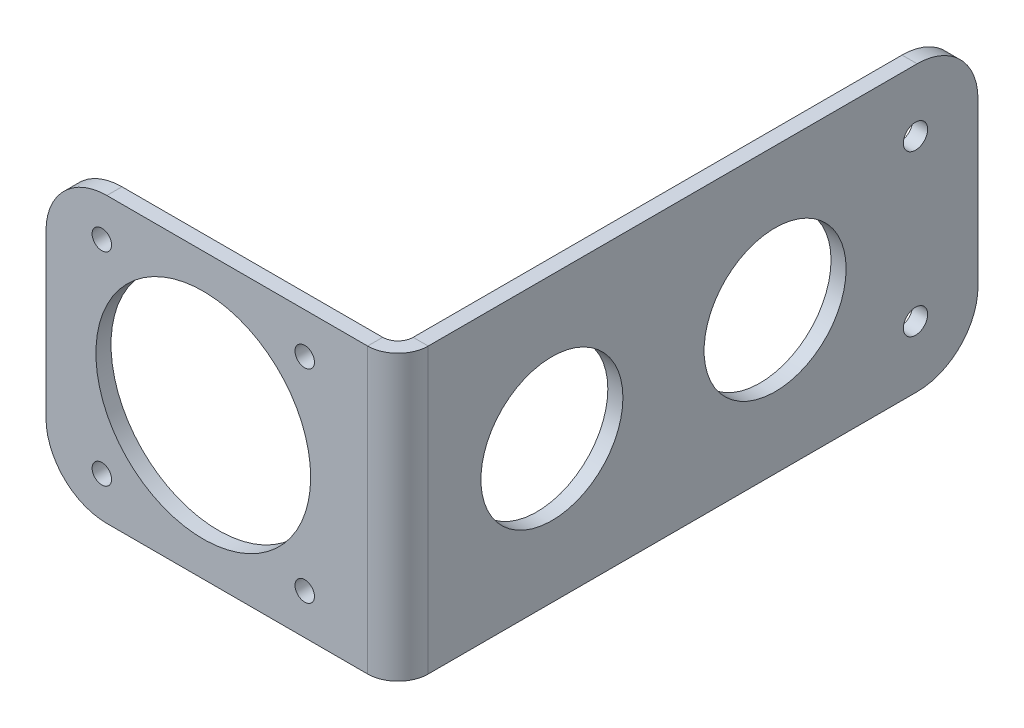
ISO-10303-21;
HEADER;
FILE_DESCRIPTION(('STEP AP214'),'2;1');
FILE_NAME('part.step','',(''),(''),'','','');
FILE_SCHEMA(('AUTOMOTIVE_DESIGN { 1 0 10303 214 1 1 1 1 }'));
ENDSEC;
DATA;
#1=APPLICATION_CONTEXT('core data for automotive mechanical design processes');
#2=APPLICATION_PROTOCOL_DEFINITION('international standard','automotive_design',2000,#1);
#3=PRODUCT_CONTEXT('',#1,'mechanical');
#4=PRODUCT('Part','Part','',(#3));
#5=PRODUCT_RELATED_PRODUCT_CATEGORY('part','',(#4));
#6=PRODUCT_DEFINITION_FORMATION('','',#4);
#7=PRODUCT_DEFINITION_CONTEXT('part definition',#1,'design');
#8=PRODUCT_DEFINITION('design','',#6,#7);
#9=PRODUCT_DEFINITION_SHAPE('','',#8);
#10=(LENGTH_UNIT() NAMED_UNIT(*) SI_UNIT(.MILLI.,.METRE.));
#11=(NAMED_UNIT(*) PLANE_ANGLE_UNIT() SI_UNIT($,.RADIAN.));
#12=(NAMED_UNIT(*) SI_UNIT($,.STERADIAN.) SOLID_ANGLE_UNIT());
#13=UNCERTAINTY_MEASURE_WITH_UNIT(LENGTH_MEASURE(1.E-05),#10,'distance_accuracy_value','');
#14=(GEOMETRIC_REPRESENTATION_CONTEXT(3) GLOBAL_UNCERTAINTY_ASSIGNED_CONTEXT((#13)) GLOBAL_UNIT_ASSIGNED_CONTEXT((#10,
#11,#12)) REPRESENTATION_CONTEXT('',''));
#15=CARTESIAN_POINT('',(0.,0.,0.));
#16=DIRECTION('',(0.,0.,1.));
#17=DIRECTION('',(1.,0.,0.));
#18=AXIS2_PLACEMENT_3D('',#15,#16,#17);
#19=CARTESIAN_POINT('',(28.0963964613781,22.225,49.7292035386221));
#20=DIRECTION('',(-1.,0.,0.));
#21=DIRECTION('',(0.,0.,1.));
#22=AXIS2_PLACEMENT_3D('',#19,#20,#21);
#23=PLANE('',#22);
#24=CARTESIAN_POINT('',(28.0963964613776,12.54125,-80.9918964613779));
#25=DIRECTION('',(1.,0.,0.));
#26=DIRECTION('',(0.,0.,-1.));
#27=AXIS2_PLACEMENT_3D('',#24,#25,#26);
#28=CIRCLE('',#27,1.89865000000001);
#29=CARTESIAN_POINT('',(28.0963964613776,12.54125,-82.8905464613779));
#30=VERTEX_POINT('',#29);
#31=EDGE_CURVE('E176',#30,#30,#28,.T.);
#32=ORIENTED_EDGE('',*,*,#31,.T.);
#33=EDGE_LOOP('',(#32));
#34=FACE_BOUND('',#33,.T.);
#35=CARTESIAN_POINT('',(28.0963964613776,-12.54125,-80.9918964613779));
#36=DIRECTION('',(1.,0.,0.));
#37=DIRECTION('',(0.,0.,-1.));
#38=AXIS2_PLACEMENT_3D('',#35,#36,#37);
#39=CIRCLE('',#38,1.89865000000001);
#40=CARTESIAN_POINT('',(28.0963964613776,-12.54125,-82.8905464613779));
#41=VERTEX_POINT('',#40);
#42=EDGE_CURVE('E291',#41,#41,#39,.T.);
#43=ORIENTED_EDGE('',*,*,#42,.T.);
#44=EDGE_LOOP('',(#43));
#45=FACE_BOUND('',#44,.T.);
#46=CARTESIAN_POINT('',(28.0963964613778,0.,-24.0958964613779));
#47=DIRECTION('',(1.,0.,0.));
#48=DIRECTION('',(0.,0.,-1.));
#49=AXIS2_PLACEMENT_3D('',#46,#47,#48);
#50=CIRCLE('',#49,11.1125);
#51=CARTESIAN_POINT('',(28.0963964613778,0.,-35.2083964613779));
#52=VERTEX_POINT('',#51);
#53=EDGE_CURVE('E285',#52,#52,#50,.T.);
#54=ORIENTED_EDGE('',*,*,#53,.T.);
#55=EDGE_LOOP('',(#54));
#56=FACE_BOUND('',#55,.T.);
#57=CARTESIAN_POINT('',(28.0963964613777,0.,-59.0208964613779));
#58=DIRECTION('',(1.,0.,0.));
#59=DIRECTION('',(0.,0.,-1.));
#60=AXIS2_PLACEMENT_3D('',#57,#58,#59);
#61=CIRCLE('',#60,11.1125);
#62=CARTESIAN_POINT('',(28.0963964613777,0.,-70.1333964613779));
#63=VERTEX_POINT('',#62);
#64=EDGE_CURVE('E279',#63,#63,#61,.T.);
#65=ORIENTED_EDGE('',*,*,#64,.T.);
#66=EDGE_LOOP('',(#65));
#67=FACE_BOUND('',#66,.T.);
#68=DIRECTION('',(0.,0.,1.));
#69=VECTOR('',#68,1.);
#70=CARTESIAN_POINT('',(28.0963964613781,22.225,49.7292035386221));
#71=LINE('',#70,#69);
#72=CARTESIAN_POINT('',(28.0963964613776,22.225,-81.2458964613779));
#73=VERTEX_POINT('',#72);
#74=CARTESIAN_POINT('',(28.0963964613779,22.225,-4.74345000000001));
#75=VERTEX_POINT('',#74);
#76=EDGE_CURVE('E144',#73,#75,#71,.T.);
#77=ORIENTED_EDGE('',*,*,#76,.F.);
#78=CARTESIAN_POINT('',(28.0963964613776,12.7,-81.2458964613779));
#79=DIRECTION('',(-1.,0.,0.));
#80=DIRECTION('',(0.,0.,1.));
#81=AXIS2_PLACEMENT_3D('',#78,#79,#80);
#82=CIRCLE('',#81,9.525);
#83=CARTESIAN_POINT('',(28.0963964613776,12.7,-90.7708964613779));
#84=VERTEX_POINT('',#83);
#85=EDGE_CURVE('E188',#73,#84,#82,.T.);
#86=ORIENTED_EDGE('',*,*,#85,.T.);
#87=DIRECTION('',(0.,1.,0.));
#88=VECTOR('',#87,1.);
#89=CARTESIAN_POINT('',(28.0963964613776,-22.225,-90.7708964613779));
#90=LINE('',#89,#88);
#91=CARTESIAN_POINT('',(28.0963964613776,-12.7,-90.7708964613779));
#92=VERTEX_POINT('',#91);
#93=EDGE_CURVE('E172',#92,#84,#90,.T.);
#94=ORIENTED_EDGE('',*,*,#93,.F.);
#95=CARTESIAN_POINT('',(28.0963964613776,-12.7,-81.2458964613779));
#96=DIRECTION('',(-1.,0.,0.));
#97=DIRECTION('',(0.,0.,1.));
#98=AXIS2_PLACEMENT_3D('',#95,#96,#97);
#99=CIRCLE('',#98,9.525);
#100=CARTESIAN_POINT('',(28.0963964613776,-22.225,-81.2458964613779));
#101=VERTEX_POINT('',#100);
#102=EDGE_CURVE('E186',#92,#101,#99,.T.);
#103=ORIENTED_EDGE('',*,*,#102,.T.);
#104=DIRECTION('',(0.,0.,-1.));
#105=VECTOR('',#104,1.);
#106=CARTESIAN_POINT('',(28.0963964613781,-22.225,49.7292035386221));
#107=LINE('',#106,#105);
#108=CARTESIAN_POINT('',(28.0963964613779,-22.225,-4.74345000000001));
#109=VERTEX_POINT('',#108);
#110=EDGE_CURVE('E136',#109,#101,#107,.T.);
#111=ORIENTED_EDGE('',*,*,#110,.F.);
#112=DIRECTION('',(0.,1.,0.));
#113=VECTOR('',#112,1.);
#114=CARTESIAN_POINT('',(28.0963964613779,22.225,-4.74345000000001));
#115=LINE('',#114,#113);
#116=EDGE_CURVE('E165',#109,#75,#115,.T.);
#117=ORIENTED_EDGE('',*,*,#116,.T.);
#118=EDGE_LOOP('',(#77,#86,#94,#103,#111,#117));
#119=FACE_BOUND('',#118,.T.);
#120=ADVANCED_FACE('F36',(#34,#45,#56,#67,#119),#23,.T.);
#121=CARTESIAN_POINT('',(28.0963964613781,-22.225,49.7292035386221));
#122=DIRECTION('',(0.,-1.,0.));
#123=DIRECTION('',(-1.,0.,0.));
#124=AXIS2_PLACEMENT_3D('',#121,#122,#123);
#125=PLANE('',#124);
#126=ORIENTED_EDGE('',*,*,#110,.T.);
#127=DIRECTION('',(1.,0.,0.));
#128=VECTOR('',#127,1.);
#129=CARTESIAN_POINT('',(28.0963964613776,-22.225,-81.2458964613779));
#130=LINE('',#129,#128);
#131=CARTESIAN_POINT('',(30.4585964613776,-22.225,-81.2458964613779));
#132=VERTEX_POINT('',#131);
#133=EDGE_CURVE('E190',#101,#132,#130,.T.);
#134=ORIENTED_EDGE('',*,*,#133,.T.);
#135=DIRECTION('',(0.,0.,-1.));
#136=VECTOR('',#135,1.);
#137=CARTESIAN_POINT('',(30.4585964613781,-22.225,49.7292035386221));
#138=LINE('',#137,#136);
#139=CARTESIAN_POINT('',(30.4585964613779,-22.225,-4.74345000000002));
#140=VERTEX_POINT('',#139);
#141=EDGE_CURVE('E174',#140,#132,#138,.T.);
#142=ORIENTED_EDGE('',*,*,#141,.F.);
#143=DIRECTION('',(-1.,0.,0.));
#144=VECTOR('',#143,1.);
#145=CARTESIAN_POINT('',(28.0963964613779,-22.225,-4.74345000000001));
#146=LINE('',#145,#144);
#147=EDGE_CURVE('E149',#140,#109,#146,.T.);
#148=ORIENTED_EDGE('',*,*,#147,.T.);
#149=EDGE_LOOP('',(#126,#134,#142,#148));
#150=FACE_BOUND('',#149,.T.);
#151=ADVANCED_FACE('F306',(#150),#125,.T.);
#152=CARTESIAN_POINT('',(28.0963964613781,22.225,49.7292035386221));
#153=DIRECTION('',(0.,1.,0.));
#154=DIRECTION('',(1.,0.,0.));
#155=AXIS2_PLACEMENT_3D('',#152,#153,#154);
#156=PLANE('',#155);
#157=DIRECTION('',(0.,0.,1.));
#158=VECTOR('',#157,1.);
#159=CARTESIAN_POINT('',(30.4585964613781,22.225,49.7292035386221));
#160=LINE('',#159,#158);
#161=CARTESIAN_POINT('',(30.4585964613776,22.225,-81.2458964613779));
#162=VERTEX_POINT('',#161);
#163=CARTESIAN_POINT('',(30.4585964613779,22.225,-4.74345000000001));
#164=VERTEX_POINT('',#163);
#165=EDGE_CURVE('E124',#162,#164,#160,.T.);
#166=ORIENTED_EDGE('',*,*,#165,.F.);
#167=DIRECTION('',(1.,0.,0.));
#168=VECTOR('',#167,1.);
#169=CARTESIAN_POINT('',(28.0963964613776,22.225,-81.2458964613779));
#170=LINE('',#169,#168);
#171=EDGE_CURVE('E184',#162,#73,#170,.F.);
#172=ORIENTED_EDGE('',*,*,#171,.T.);
#173=ORIENTED_EDGE('',*,*,#76,.T.);
#174=DIRECTION('',(1.,0.,0.));
#175=VECTOR('',#174,1.);
#176=CARTESIAN_POINT('',(28.0963964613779,22.225,-4.74345000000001));
#177=LINE('',#176,#175);
#178=EDGE_CURVE('E140',#75,#164,#177,.T.);
#179=ORIENTED_EDGE('',*,*,#178,.T.);
#180=EDGE_LOOP('',(#166,#172,#173,#179));
#181=FACE_BOUND('',#180,.T.);
#182=ADVANCED_FACE('F142',(#181),#156,.T.);
#183=CARTESIAN_POINT('',(28.0963964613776,-22.225,-90.7708964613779));
#184=DIRECTION('',(0.,0.,-1.));
#185=DIRECTION('',(-1.,0.,0.));
#186=AXIS2_PLACEMENT_3D('',#183,#184,#185);
#187=PLANE('',#186);
#188=ORIENTED_EDGE('',*,*,#93,.T.);
#189=DIRECTION('',(1.,0.,0.));
#190=VECTOR('',#189,1.);
#191=CARTESIAN_POINT('',(28.0963964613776,12.7,-90.7708964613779));
#192=LINE('',#191,#190);
#193=CARTESIAN_POINT('',(30.4585964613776,12.7,-90.7708964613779));
#194=VERTEX_POINT('',#193);
#195=EDGE_CURVE('E167',#84,#194,#192,.T.);
#196=ORIENTED_EDGE('',*,*,#195,.T.);
#197=DIRECTION('',(0.,1.,0.));
#198=VECTOR('',#197,1.);
#199=CARTESIAN_POINT('',(30.4585964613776,-22.225,-90.7708964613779));
#200=LINE('',#199,#198);
#201=CARTESIAN_POINT('',(30.4585964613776,-12.7,-90.7708964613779));
#202=VERTEX_POINT('',#201);
#203=EDGE_CURVE('E137',#202,#194,#200,.T.);
#204=ORIENTED_EDGE('',*,*,#203,.F.);
#205=DIRECTION('',(1.,0.,0.));
#206=VECTOR('',#205,1.);
#207=CARTESIAN_POINT('',(28.0963964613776,-12.7,-90.7708964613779));
#208=LINE('',#207,#206);
#209=EDGE_CURVE('E164',#202,#92,#208,.F.);
#210=ORIENTED_EDGE('',*,*,#209,.T.);
#211=EDGE_LOOP('',(#188,#196,#204,#210));
#212=FACE_BOUND('',#211,.T.);
#213=ADVANCED_FACE('F343',(#212),#187,.T.);
#214=CARTESIAN_POINT('',(30.4585964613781,22.225,49.7292035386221));
#215=DIRECTION('',(-1.,0.,0.));
#216=DIRECTION('',(0.,0.,1.));
#217=AXIS2_PLACEMENT_3D('',#214,#215,#216);
#218=PLANE('',#217);
#219=ORIENTED_EDGE('',*,*,#203,.T.);
#220=CARTESIAN_POINT('',(30.4585964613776,12.7,-81.2458964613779));
#221=DIRECTION('',(-1.,0.,0.));
#222=DIRECTION('',(0.,0.,1.));
#223=AXIS2_PLACEMENT_3D('',#220,#221,#222);
#224=CIRCLE('',#223,9.525);
#225=EDGE_CURVE('E133',#194,#162,#224,.F.);
#226=ORIENTED_EDGE('',*,*,#225,.T.);
#227=ORIENTED_EDGE('',*,*,#165,.T.);
#228=DIRECTION('',(0.,1.,0.));
#229=VECTOR('',#228,1.);
#230=CARTESIAN_POINT('',(30.4585964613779,22.225,-4.74345000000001));
#231=LINE('',#230,#229);
#232=EDGE_CURVE('E131',#140,#164,#231,.T.);
#233=ORIENTED_EDGE('',*,*,#232,.F.);
#234=ORIENTED_EDGE('',*,*,#141,.T.);
#235=CARTESIAN_POINT('',(30.4585964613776,-12.7,-81.2458964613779));
#236=DIRECTION('',(-1.,0.,0.));
#237=DIRECTION('',(0.,0.,1.));
#238=AXIS2_PLACEMENT_3D('',#235,#236,#237);
#239=CIRCLE('',#238,9.525);
#240=EDGE_CURVE('E181',#132,#202,#239,.F.);
#241=ORIENTED_EDGE('',*,*,#240,.T.);
#242=EDGE_LOOP('',(#219,#226,#227,#233,#234,#241));
#243=FACE_BOUND('',#242,.T.);
#244=CARTESIAN_POINT('',(30.4585964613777,0.,-59.0208964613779));
#245=DIRECTION('',(1.,0.,0.));
#246=DIRECTION('',(0.,0.,-1.));
#247=AXIS2_PLACEMENT_3D('',#244,#245,#246);
#248=CIRCLE('',#247,11.1125);
#249=CARTESIAN_POINT('',(30.4585964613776,0.,-70.1333964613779));
#250=VERTEX_POINT('',#249);
#251=EDGE_CURVE('E221',#250,#250,#248,.T.);
#252=ORIENTED_EDGE('',*,*,#251,.F.);
#253=EDGE_LOOP('',(#252));
#254=FACE_BOUND('',#253,.T.);
#255=CARTESIAN_POINT('',(30.4585964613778,0.,-24.0958964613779));
#256=DIRECTION('',(1.,0.,0.));
#257=DIRECTION('',(0.,0.,-1.));
#258=AXIS2_PLACEMENT_3D('',#255,#256,#257);
#259=CIRCLE('',#258,11.1125);
#260=CARTESIAN_POINT('',(30.4585964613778,0.,-35.2083964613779));
#261=VERTEX_POINT('',#260);
#262=EDGE_CURVE('E282',#261,#261,#259,.T.);
#263=ORIENTED_EDGE('',*,*,#262,.F.);
#264=EDGE_LOOP('',(#263));
#265=FACE_BOUND('',#264,.T.);
#266=CARTESIAN_POINT('',(30.4585964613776,-12.54125,-80.9918964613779));
#267=DIRECTION('',(1.,0.,0.));
#268=DIRECTION('',(0.,0.,-1.));
#269=AXIS2_PLACEMENT_3D('',#266,#267,#268);
#270=CIRCLE('',#269,1.89865000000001);
#271=CARTESIAN_POINT('',(30.4585964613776,-12.54125,-82.8905464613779));
#272=VERTEX_POINT('',#271);
#273=EDGE_CURVE('E288',#272,#272,#270,.T.);
#274=ORIENTED_EDGE('',*,*,#273,.F.);
#275=EDGE_LOOP('',(#274));
#276=FACE_BOUND('',#275,.T.);
#277=CARTESIAN_POINT('',(30.4585964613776,12.54125,-80.9918964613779));
#278=DIRECTION('',(1.,0.,0.));
#279=DIRECTION('',(0.,0.,-1.));
#280=AXIS2_PLACEMENT_3D('',#277,#278,#279);
#281=CIRCLE('',#280,1.89865000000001);
#282=CARTESIAN_POINT('',(30.4585964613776,12.54125,-82.8905464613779));
#283=VERTEX_POINT('',#282);
#284=EDGE_CURVE('E294',#283,#283,#281,.T.);
#285=ORIENTED_EDGE('',*,*,#284,.F.);
#286=EDGE_LOOP('',(#285));
#287=FACE_BOUND('',#286,.T.);
#288=ADVANCED_FACE('F127',(#243,#254,#265,#276,#287),#218,.F.);
#289=CARTESIAN_POINT('',(28.0963964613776,12.54125,-80.9918964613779));
#290=DIRECTION('',(1.,0.,0.));
#291=DIRECTION('',(0.,0.,-1.));
#292=AXIS2_PLACEMENT_3D('',#289,#290,#291);
#293=CYLINDRICAL_SURFACE('',#292,1.89865000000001);
#294=ORIENTED_EDGE('',*,*,#31,.F.);
#295=EDGE_LOOP('',(#294));
#296=FACE_BOUND('',#295,.T.);
#297=ORIENTED_EDGE('',*,*,#284,.T.);
#298=EDGE_LOOP('',(#297));
#299=FACE_BOUND('',#298,.T.);
#300=ADVANCED_FACE('F348',(#296,#299),#293,.F.);
#301=CARTESIAN_POINT('',(28.0963964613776,-12.54125,-80.9918964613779));
#302=DIRECTION('',(1.,0.,0.));
#303=DIRECTION('',(0.,0.,-1.));
#304=AXIS2_PLACEMENT_3D('',#301,#302,#303);
#305=CYLINDRICAL_SURFACE('',#304,1.89865000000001);
#306=ORIENTED_EDGE('',*,*,#42,.F.);
#307=EDGE_LOOP('',(#306));
#308=FACE_BOUND('',#307,.T.);
#309=ORIENTED_EDGE('',*,*,#273,.T.);
#310=EDGE_LOOP('',(#309));
#311=FACE_BOUND('',#310,.T.);
#312=ADVANCED_FACE('F546',(#308,#311),#305,.F.);
#313=CARTESIAN_POINT('',(28.0963964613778,0.,-24.0958964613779));
#314=DIRECTION('',(1.,0.,0.));
#315=DIRECTION('',(0.,0.,-1.));
#316=AXIS2_PLACEMENT_3D('',#313,#314,#315);
#317=CYLINDRICAL_SURFACE('',#316,11.1125);
#318=ORIENTED_EDGE('',*,*,#53,.F.);
#319=EDGE_LOOP('',(#318));
#320=FACE_BOUND('',#319,.T.);
#321=ORIENTED_EDGE('',*,*,#262,.T.);
#322=EDGE_LOOP('',(#321));
#323=FACE_BOUND('',#322,.T.);
#324=ADVANCED_FACE('F536',(#320,#323),#317,.F.);
#325=CARTESIAN_POINT('',(28.0963964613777,0.,-59.0208964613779));
#326=DIRECTION('',(1.,0.,0.));
#327=DIRECTION('',(0.,0.,-1.));
#328=AXIS2_PLACEMENT_3D('',#325,#326,#327);
#329=CYLINDRICAL_SURFACE('',#328,11.1125);
#330=ORIENTED_EDGE('',*,*,#64,.F.);
#331=EDGE_LOOP('',(#330));
#332=FACE_BOUND('',#331,.T.);
#333=ORIENTED_EDGE('',*,*,#251,.T.);
#334=EDGE_LOOP('',(#333));
#335=FACE_BOUND('',#334,.T.);
#336=ADVANCED_FACE('F526',(#332,#335),#329,.F.);
#337=CARTESIAN_POINT('',(0.,0.,-2.3622));
#338=DIRECTION('',(0.,0.,1.));
#339=DIRECTION('',(1.,0.,0.));
#340=AXIS2_PLACEMENT_3D('',#337,#338,#339);
#341=CYLINDRICAL_SURFACE('',#340,16.8021);
#342=CARTESIAN_POINT('',(0.,0.,-2.3622));
#343=DIRECTION('',(0.,0.,1.));
#344=DIRECTION('',(1.,0.,0.));
#345=AXIS2_PLACEMENT_3D('',#342,#343,#344);
#346=CIRCLE('',#345,16.8021);
#347=CARTESIAN_POINT('',(16.8021,0.,-2.3622));
#348=VERTEX_POINT('',#347);
#349=EDGE_CURVE('E243',#348,#348,#346,.T.);
#350=ORIENTED_EDGE('',*,*,#349,.F.);
#351=EDGE_LOOP('',(#350));
#352=FACE_BOUND('',#351,.T.);
#353=CARTESIAN_POINT('',(0.,0.,0.));
#354=DIRECTION('',(0.,0.,1.));
#355=DIRECTION('',(1.,0.,0.));
#356=AXIS2_PLACEMENT_3D('',#353,#354,#355);
#357=CIRCLE('',#356,16.8021);
#358=CARTESIAN_POINT('',(16.8021,0.,0.));
#359=VERTEX_POINT('',#358);
#360=EDGE_CURVE('E271',#359,#359,#357,.T.);
#361=ORIENTED_EDGE('',*,*,#360,.T.);
#362=EDGE_LOOP('',(#361));
#363=FACE_BOUND('',#362,.T.);
#364=ADVANCED_FACE('F516',(#352,#363),#341,.F.);
#365=CARTESIAN_POINT('',(15.875,15.875,-2.3622));
#366=DIRECTION('',(0.,0.,1.));
#367=DIRECTION('',(1.,0.,0.));
#368=AXIS2_PLACEMENT_3D('',#365,#366,#367);
#369=CYLINDRICAL_SURFACE('',#368,1.52400000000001);
#370=CARTESIAN_POINT('',(15.875,15.875,-2.3622));
#371=DIRECTION('',(0.,0.,1.));
#372=DIRECTION('',(1.,0.,0.));
#373=AXIS2_PLACEMENT_3D('',#370,#371,#372);
#374=CIRCLE('',#373,1.52400000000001);
#375=CARTESIAN_POINT('',(17.399,15.875,-2.3622));
#376=VERTEX_POINT('',#375);
#377=EDGE_CURVE('E246',#376,#376,#374,.T.);
#378=ORIENTED_EDGE('',*,*,#377,.F.);
#379=EDGE_LOOP('',(#378));
#380=FACE_BOUND('',#379,.T.);
#381=CARTESIAN_POINT('',(15.875,15.875,0.));
#382=DIRECTION('',(0.,0.,1.));
#383=DIRECTION('',(1.,0.,0.));
#384=AXIS2_PLACEMENT_3D('',#381,#382,#383);
#385=CIRCLE('',#384,1.52400000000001);
#386=CARTESIAN_POINT('',(17.399,15.875,0.));
#387=VERTEX_POINT('',#386);
#388=EDGE_CURVE('E268',#387,#387,#385,.T.);
#389=ORIENTED_EDGE('',*,*,#388,.T.);
#390=EDGE_LOOP('',(#389));
#391=FACE_BOUND('',#390,.T.);
#392=ADVANCED_FACE('F506',(#380,#391),#369,.F.);
#393=CARTESIAN_POINT('',(-15.875,15.875,-2.3622));
#394=DIRECTION('',(0.,0.,1.));
#395=DIRECTION('',(1.,0.,0.));
#396=AXIS2_PLACEMENT_3D('',#393,#394,#395);
#397=CYLINDRICAL_SURFACE('',#396,1.524);
#398=CARTESIAN_POINT('',(-15.875,15.875,-2.3622));
#399=DIRECTION('',(0.,0.,1.));
#400=DIRECTION('',(1.,0.,0.));
#401=AXIS2_PLACEMENT_3D('',#398,#399,#400);
#402=CIRCLE('',#401,1.524);
#403=CARTESIAN_POINT('',(-14.351,15.875,-2.3622));
#404=VERTEX_POINT('',#403);
#405=EDGE_CURVE('E249',#404,#404,#402,.T.);
#406=ORIENTED_EDGE('',*,*,#405,.F.);
#407=EDGE_LOOP('',(#406));
#408=FACE_BOUND('',#407,.T.);
#409=CARTESIAN_POINT('',(-15.875,15.875,0.));
#410=DIRECTION('',(0.,0.,1.));
#411=DIRECTION('',(1.,0.,0.));
#412=AXIS2_PLACEMENT_3D('',#409,#410,#411);
#413=CIRCLE('',#412,1.524);
#414=CARTESIAN_POINT('',(-14.351,15.875,0.));
#415=VERTEX_POINT('',#414);
#416=EDGE_CURVE('E265',#415,#415,#413,.T.);
#417=ORIENTED_EDGE('',*,*,#416,.T.);
#418=EDGE_LOOP('',(#417));
#419=FACE_BOUND('',#418,.T.);
#420=ADVANCED_FACE('F496',(#408,#419),#397,.F.);
#421=CARTESIAN_POINT('',(-15.875,-15.875,-2.3622));
#422=DIRECTION('',(0.,0.,1.));
#423=DIRECTION('',(1.,0.,0.));
#424=AXIS2_PLACEMENT_3D('',#421,#422,#423);
#425=CYLINDRICAL_SURFACE('',#424,1.524);
#426=CARTESIAN_POINT('',(-15.875,-15.875,-2.3622));
#427=DIRECTION('',(0.,0.,1.));
#428=DIRECTION('',(1.,0.,0.));
#429=AXIS2_PLACEMENT_3D('',#426,#427,#428);
#430=CIRCLE('',#429,1.524);
#431=CARTESIAN_POINT('',(-14.351,-15.875,-2.3622));
#432=VERTEX_POINT('',#431);
#433=EDGE_CURVE('E252',#432,#432,#430,.T.);
#434=ORIENTED_EDGE('',*,*,#433,.F.);
#435=EDGE_LOOP('',(#434));
#436=FACE_BOUND('',#435,.T.);
#437=CARTESIAN_POINT('',(-15.875,-15.875,0.));
#438=DIRECTION('',(0.,0.,1.));
#439=DIRECTION('',(1.,0.,0.));
#440=AXIS2_PLACEMENT_3D('',#437,#438,#439);
#441=CIRCLE('',#440,1.524);
#442=CARTESIAN_POINT('',(-14.351,-15.875,0.));
#443=VERTEX_POINT('',#442);
#444=EDGE_CURVE('E262',#443,#443,#441,.T.);
#445=ORIENTED_EDGE('',*,*,#444,.T.);
#446=EDGE_LOOP('',(#445));
#447=FACE_BOUND('',#446,.T.);
#448=ADVANCED_FACE('F486',(#436,#447),#425,.F.);
#449=CARTESIAN_POINT('',(15.875,-15.875,-2.3622));
#450=DIRECTION('',(0.,0.,1.));
#451=DIRECTION('',(1.,0.,0.));
#452=AXIS2_PLACEMENT_3D('',#449,#450,#451);
#453=CYLINDRICAL_SURFACE('',#452,1.52400000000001);
#454=CARTESIAN_POINT('',(15.875,-15.875,-2.3622));
#455=DIRECTION('',(0.,0.,1.));
#456=DIRECTION('',(1.,0.,0.));
#457=AXIS2_PLACEMENT_3D('',#454,#455,#456);
#458=CIRCLE('',#457,1.52400000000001);
#459=CARTESIAN_POINT('',(17.399,-15.875,-2.3622));
#460=VERTEX_POINT('',#459);
#461=EDGE_CURVE('E255',#460,#460,#458,.T.);
#462=ORIENTED_EDGE('',*,*,#461,.F.);
#463=EDGE_LOOP('',(#462));
#464=FACE_BOUND('',#463,.T.);
#465=CARTESIAN_POINT('',(15.875,-15.875,0.));
#466=DIRECTION('',(0.,0.,1.));
#467=DIRECTION('',(1.,0.,0.));
#468=AXIS2_PLACEMENT_3D('',#465,#466,#467);
#469=CIRCLE('',#468,1.52400000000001);
#470=CARTESIAN_POINT('',(17.399,-15.875,0.));
#471=VERTEX_POINT('',#470);
#472=EDGE_CURVE('E259',#471,#471,#469,.T.);
#473=ORIENTED_EDGE('',*,*,#472,.T.);
#474=EDGE_LOOP('',(#473));
#475=FACE_BOUND('',#474,.T.);
#476=ADVANCED_FACE('F417',(#464,#475),#453,.F.);
#477=CARTESIAN_POINT('',(-24.6126,-22.225,-2.3622));
#478=DIRECTION('',(-1.,0.,0.));
#479=DIRECTION('',(0.,0.,1.));
#480=AXIS2_PLACEMENT_3D('',#477,#478,#479);
#481=PLANE('',#480);
#482=DIRECTION('',(0.,-1.,0.));
#483=VECTOR('',#482,1.);
#484=CARTESIAN_POINT('',(-24.6126,-22.225,0.));
#485=LINE('',#484,#483);
#486=CARTESIAN_POINT('',(-24.6126,12.7,0.));
#487=VERTEX_POINT('',#486);
#488=CARTESIAN_POINT('',(-24.6126,-12.7,0.));
#489=VERTEX_POINT('',#488);
#490=EDGE_CURVE('E222',#487,#489,#485,.T.);
#491=ORIENTED_EDGE('',*,*,#490,.F.);
#492=DIRECTION('',(0.,0.,1.));
#493=VECTOR('',#492,1.);
#494=CARTESIAN_POINT('',(-24.6126,12.7,-2.3622));
#495=LINE('',#494,#493);
#496=CARTESIAN_POINT('',(-24.6126,12.7,-2.3622));
#497=VERTEX_POINT('',#496);
#498=EDGE_CURVE('E203',#487,#497,#495,.F.);
#499=ORIENTED_EDGE('',*,*,#498,.T.);
#500=DIRECTION('',(0.,-1.,0.));
#501=VECTOR('',#500,1.);
#502=CARTESIAN_POINT('',(-24.6126,-22.225,-2.3622));
#503=LINE('',#502,#501);
#504=CARTESIAN_POINT('',(-24.6126,-12.7,-2.3622));
#505=VERTEX_POINT('',#504);
#506=EDGE_CURVE('E213',#497,#505,#503,.T.);
#507=ORIENTED_EDGE('',*,*,#506,.T.);
#508=DIRECTION('',(0.,0.,1.));
#509=VECTOR('',#508,1.);
#510=CARTESIAN_POINT('',(-24.6126,-12.7,-2.3622));
#511=LINE('',#510,#509);
#512=EDGE_CURVE('E200',#505,#489,#511,.T.);
#513=ORIENTED_EDGE('',*,*,#512,.T.);
#514=EDGE_LOOP('',(#491,#499,#507,#513));
#515=FACE_BOUND('',#514,.T.);
#516=ADVANCED_FACE('F231',(#515),#481,.T.);
#517=CARTESIAN_POINT('',(-24.6126,22.225,-2.3622));
#518=DIRECTION('',(0.,0.,-1.));
#519=DIRECTION('',(-1.,0.,0.));
#520=AXIS2_PLACEMENT_3D('',#517,#518,#519);
#521=PLANE('',#520);
#522=ORIENTED_EDGE('',*,*,#506,.F.);
#523=CARTESIAN_POINT('',(-15.0876,12.7,-2.3622));
#524=DIRECTION('',(0.,0.,-1.));
#525=DIRECTION('',(-1.,0.,0.));
#526=AXIS2_PLACEMENT_3D('',#523,#524,#525);
#527=CIRCLE('',#526,9.525);
#528=CARTESIAN_POINT('',(-15.0876,22.225,-2.3622));
#529=VERTEX_POINT('',#528);
#530=EDGE_CURVE('E44',#497,#529,#527,.T.);
#531=ORIENTED_EDGE('',*,*,#530,.T.);
#532=DIRECTION('',(-1.,0.,0.));
#533=VECTOR('',#532,1.);
#534=CARTESIAN_POINT('',(-24.6126,22.225,-2.3622));
#535=LINE('',#534,#533);
#536=CARTESIAN_POINT('',(25.7151464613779,22.225,-2.3622));
#537=VERTEX_POINT('',#536);
#538=EDGE_CURVE('E211',#537,#529,#535,.T.);
#539=ORIENTED_EDGE('',*,*,#538,.F.);
#540=DIRECTION('',(0.,1.,0.));
#541=VECTOR('',#540,1.);
#542=CARTESIAN_POINT('',(25.7151464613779,22.225,-2.3622));
#543=LINE('',#542,#541);
#544=CARTESIAN_POINT('',(25.7151464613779,-22.225,-2.3622));
#545=VERTEX_POINT('',#544);
#546=EDGE_CURVE('E158',#545,#537,#543,.T.);
#547=ORIENTED_EDGE('',*,*,#546,.F.);
#548=DIRECTION('',(1.,0.,0.));
#549=VECTOR('',#548,1.);
#550=CARTESIAN_POINT('',(-24.6126,-22.225,-2.3622));
#551=LINE('',#550,#549);
#552=CARTESIAN_POINT('',(-15.0876,-22.225,-2.3622));
#553=VERTEX_POINT('',#552);
#554=EDGE_CURVE('E241',#553,#545,#551,.T.);
#555=ORIENTED_EDGE('',*,*,#554,.F.);
#556=CARTESIAN_POINT('',(-15.0876,-12.7,-2.3622));
#557=DIRECTION('',(0.,0.,-1.));
#558=DIRECTION('',(-1.,0.,0.));
#559=AXIS2_PLACEMENT_3D('',#556,#557,#558);
#560=CIRCLE('',#559,9.525);
#561=EDGE_CURVE('E56',#553,#505,#560,.T.);
#562=ORIENTED_EDGE('',*,*,#561,.T.);
#563=EDGE_LOOP('',(#522,#531,#539,#547,#555,#562));
#564=FACE_BOUND('',#563,.T.);
#565=ORIENTED_EDGE('',*,*,#461,.T.);
#566=EDGE_LOOP('',(#565));
#567=FACE_BOUND('',#566,.T.);
#568=ORIENTED_EDGE('',*,*,#433,.T.);
#569=EDGE_LOOP('',(#568));
#570=FACE_BOUND('',#569,.T.);
#571=ORIENTED_EDGE('',*,*,#405,.T.);
#572=EDGE_LOOP('',(#571));
#573=FACE_BOUND('',#572,.T.);
#574=ORIENTED_EDGE('',*,*,#377,.T.);
#575=EDGE_LOOP('',(#574));
#576=FACE_BOUND('',#575,.T.);
#577=ORIENTED_EDGE('',*,*,#349,.T.);
#578=EDGE_LOOP('',(#577));
#579=FACE_BOUND('',#578,.T.);
#580=ADVANCED_FACE('F208',(#564,#567,#570,#573,#576,#579),#521,.T.);
#581=CARTESIAN_POINT('',(-24.6126,-22.225,-2.3622));
#582=DIRECTION('',(0.,-1.,0.));
#583=DIRECTION('',(0.,0.,-1.));
#584=AXIS2_PLACEMENT_3D('',#581,#582,#583);
#585=PLANE('',#584);
#586=DIRECTION('',(1.,0.,0.));
#587=VECTOR('',#586,1.);
#588=CARTESIAN_POINT('',(-24.6126,-22.225,0.));
#589=LINE('',#588,#587);
#590=CARTESIAN_POINT('',(-15.0876,-22.225,0.));
#591=VERTEX_POINT('',#590);
#592=CARTESIAN_POINT('',(25.7151464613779,-22.225,0.));
#593=VERTEX_POINT('',#592);
#594=EDGE_CURVE('E239',#591,#593,#589,.T.);
#595=ORIENTED_EDGE('',*,*,#594,.F.);
#596=DIRECTION('',(0.,0.,1.));
#597=VECTOR('',#596,1.);
#598=CARTESIAN_POINT('',(-15.0876,-22.225,-2.3622));
#599=LINE('',#598,#597);
#600=EDGE_CURVE('E11',#591,#553,#599,.F.);
#601=ORIENTED_EDGE('',*,*,#600,.T.);
#602=ORIENTED_EDGE('',*,*,#554,.T.);
#603=DIRECTION('',(0.,0.,-1.));
#604=VECTOR('',#603,1.);
#605=CARTESIAN_POINT('',(25.7151464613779,-22.225,-2.3622));
#606=LINE('',#605,#604);
#607=EDGE_CURVE('E274',#593,#545,#606,.T.);
#608=ORIENTED_EDGE('',*,*,#607,.F.);
#609=EDGE_LOOP('',(#595,#601,#602,#608));
#610=FACE_BOUND('',#609,.T.);
#611=ADVANCED_FACE('F324',(#610),#585,.T.);
#612=CARTESIAN_POINT('',(-24.6126,22.225,0.));
#613=DIRECTION('',(0.,0.,-1.));
#614=DIRECTION('',(-1.,0.,0.));
#615=AXIS2_PLACEMENT_3D('',#612,#613,#614);
#616=PLANE('',#615);
#617=ORIENTED_EDGE('',*,*,#472,.F.);
#618=EDGE_LOOP('',(#617));
#619=FACE_BOUND('',#618,.T.);
#620=ORIENTED_EDGE('',*,*,#444,.F.);
#621=EDGE_LOOP('',(#620));
#622=FACE_BOUND('',#621,.T.);
#623=ORIENTED_EDGE('',*,*,#416,.F.);
#624=EDGE_LOOP('',(#623));
#625=FACE_BOUND('',#624,.T.);
#626=ORIENTED_EDGE('',*,*,#388,.F.);
#627=EDGE_LOOP('',(#626));
#628=FACE_BOUND('',#627,.T.);
#629=ORIENTED_EDGE('',*,*,#360,.F.);
#630=EDGE_LOOP('',(#629));
#631=FACE_BOUND('',#630,.T.);
#632=DIRECTION('',(-1.,0.,0.));
#633=VECTOR('',#632,1.);
#634=CARTESIAN_POINT('',(-24.6126,22.225,0.));
#635=LINE('',#634,#633);
#636=CARTESIAN_POINT('',(25.7151464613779,22.225,0.));
#637=VERTEX_POINT('',#636);
#638=CARTESIAN_POINT('',(-15.0876,22.225,0.));
#639=VERTEX_POINT('',#638);
#640=EDGE_CURVE('E229',#637,#639,#635,.T.);
#641=ORIENTED_EDGE('',*,*,#640,.T.);
#642=CARTESIAN_POINT('',(-15.0876,12.7,0.));
#643=DIRECTION('',(0.,0.,-1.));
#644=DIRECTION('',(-1.,0.,0.));
#645=AXIS2_PLACEMENT_3D('',#642,#643,#644);
#646=CIRCLE('',#645,9.525);
#647=EDGE_CURVE('E198',#639,#487,#646,.F.);
#648=ORIENTED_EDGE('',*,*,#647,.T.);
#649=ORIENTED_EDGE('',*,*,#490,.T.);
#650=CARTESIAN_POINT('',(-15.0876,-12.7,0.));
#651=DIRECTION('',(0.,0.,-1.));
#652=DIRECTION('',(-1.,0.,0.));
#653=AXIS2_PLACEMENT_3D('',#650,#651,#652);
#654=CIRCLE('',#653,9.525);
#655=EDGE_CURVE('E196',#489,#591,#654,.F.);
#656=ORIENTED_EDGE('',*,*,#655,.T.);
#657=ORIENTED_EDGE('',*,*,#594,.T.);
#658=DIRECTION('',(0.,1.,0.));
#659=VECTOR('',#658,1.);
#660=CARTESIAN_POINT('',(25.7151464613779,22.225,0.));
#661=LINE('',#660,#659);
#662=EDGE_CURVE('E234',#593,#637,#661,.T.);
#663=ORIENTED_EDGE('',*,*,#662,.T.);
#664=EDGE_LOOP('',(#641,#648,#649,#656,#657,#663));
#665=FACE_BOUND('',#664,.T.);
#666=ADVANCED_FACE('F228',(#619,#622,#625,#628,#631,#665),#616,.F.);
#667=CARTESIAN_POINT('',(-24.6126,22.225,-2.3622));
#668=DIRECTION('',(0.,1.,0.));
#669=DIRECTION('',(0.,0.,1.));
#670=AXIS2_PLACEMENT_3D('',#667,#668,#669);
#671=PLANE('',#670);
#672=ORIENTED_EDGE('',*,*,#538,.T.);
#673=DIRECTION('',(0.,0.,1.));
#674=VECTOR('',#673,1.);
#675=CARTESIAN_POINT('',(-15.0876,22.225,-2.3622));
#676=LINE('',#675,#674);
#677=EDGE_CURVE('E193',#529,#639,#676,.T.);
#678=ORIENTED_EDGE('',*,*,#677,.T.);
#679=ORIENTED_EDGE('',*,*,#640,.F.);
#680=DIRECTION('',(0.,0.,1.));
#681=VECTOR('',#680,1.);
#682=CARTESIAN_POINT('',(25.7151464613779,22.225,-2.3622));
#683=LINE('',#682,#681);
#684=EDGE_CURVE('E155',#537,#637,#683,.T.);
#685=ORIENTED_EDGE('',*,*,#684,.F.);
#686=EDGE_LOOP('',(#672,#678,#679,#685));
#687=FACE_BOUND('',#686,.T.);
#688=ADVANCED_FACE('F218',(#687),#671,.T.);
#689=CARTESIAN_POINT('',(25.7151464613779,22.225,-4.74345));
#690=DIRECTION('',(0.,1.,0.));
#691=DIRECTION('',(0.,0.,1.));
#692=AXIS2_PLACEMENT_3D('',#689,#690,#691);
#693=PLANE('',#692);
#694=ORIENTED_EDGE('',*,*,#178,.F.);
#695=CARTESIAN_POINT('',(25.7151464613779,22.225,-4.74345));
#696=DIRECTION('',(0.,-1.,0.));
#697=DIRECTION('',(1.,0.,0.));
#698=AXIS2_PLACEMENT_3D('',#695,#696,#697);
#699=CIRCLE('',#698,2.38125);
#700=EDGE_CURVE('E319',#75,#537,#699,.T.);
#701=ORIENTED_EDGE('',*,*,#700,.T.);
#702=ORIENTED_EDGE('',*,*,#684,.T.);
#703=CARTESIAN_POINT('',(25.7151464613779,22.225,-4.74345));
#704=DIRECTION('',(0.,-1.,0.));
#705=DIRECTION('',(1.,0.,0.));
#706=AXIS2_PLACEMENT_3D('',#703,#704,#705);
#707=CIRCLE('',#706,4.74345);
#708=EDGE_CURVE('E153',#164,#637,#707,.T.);
#709=ORIENTED_EDGE('',*,*,#708,.F.);
#710=EDGE_LOOP('',(#694,#701,#702,#709));
#711=FACE_BOUND('',#710,.T.);
#712=ADVANCED_FACE('F154',(#711),#693,.T.);
#713=CARTESIAN_POINT('',(25.7151464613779,-22.225,-4.74345));
#714=DIRECTION('',(0.,-1.,0.));
#715=DIRECTION('',(0.,0.,-1.));
#716=AXIS2_PLACEMENT_3D('',#713,#714,#715);
#717=PLANE('',#716);
#718=ORIENTED_EDGE('',*,*,#607,.T.);
#719=CARTESIAN_POINT('',(25.7151464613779,-22.225,-4.74345));
#720=DIRECTION('',(0.,-1.,0.));
#721=DIRECTION('',(1.,0.,0.));
#722=AXIS2_PLACEMENT_3D('',#719,#720,#721);
#723=CIRCLE('',#722,2.38125);
#724=EDGE_CURVE('E315',#545,#109,#723,.F.);
#725=ORIENTED_EDGE('',*,*,#724,.T.);
#726=ORIENTED_EDGE('',*,*,#147,.F.);
#727=CARTESIAN_POINT('',(25.7151464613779,-22.225,-4.74345));
#728=DIRECTION('',(0.,-1.,0.));
#729=DIRECTION('',(1.,0.,0.));
#730=AXIS2_PLACEMENT_3D('',#727,#728,#729);
#731=CIRCLE('',#730,4.74345);
#732=EDGE_CURVE('E159',#593,#140,#731,.F.);
#733=ORIENTED_EDGE('',*,*,#732,.F.);
#734=EDGE_LOOP('',(#718,#725,#726,#733));
#735=FACE_BOUND('',#734,.T.);
#736=ADVANCED_FACE('F316',(#735),#717,.T.);
#737=CARTESIAN_POINT('',(25.7151464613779,189.751925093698,-4.74345));
#738=DIRECTION('',(0.,-1.,0.));
#739=DIRECTION('',(1.,0.,0.));
#740=AXIS2_PLACEMENT_3D('',#737,#738,#739);
#741=CYLINDRICAL_SURFACE('',#740,4.74345);
#742=ORIENTED_EDGE('',*,*,#732,.T.);
#743=ORIENTED_EDGE('',*,*,#232,.T.);
#744=ORIENTED_EDGE('',*,*,#708,.T.);
#745=ORIENTED_EDGE('',*,*,#662,.F.);
#746=EDGE_LOOP('',(#742,#743,#744,#745));
#747=FACE_BOUND('',#746,.T.);
#748=ADVANCED_FACE('F162',(#747),#741,.T.);
#749=CARTESIAN_POINT('',(25.7151464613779,189.751925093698,-4.74345));
#750=DIRECTION('',(0.,-1.,0.));
#751=DIRECTION('',(1.,0.,0.));
#752=AXIS2_PLACEMENT_3D('',#749,#750,#751);
#753=CYLINDRICAL_SURFACE('',#752,2.38125);
#754=ORIENTED_EDGE('',*,*,#724,.F.);
#755=ORIENTED_EDGE('',*,*,#546,.T.);
#756=ORIENTED_EDGE('',*,*,#700,.F.);
#757=ORIENTED_EDGE('',*,*,#116,.F.);
#758=EDGE_LOOP('',(#754,#755,#756,#757));
#759=FACE_BOUND('',#758,.T.);
#760=ADVANCED_FACE('F321',(#759),#753,.F.);
#761=CARTESIAN_POINT('',(28.0963964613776,12.7,-81.2458964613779));
#762=DIRECTION('',(1.,0.,0.));
#763=DIRECTION('',(0.,0.,-1.));
#764=AXIS2_PLACEMENT_3D('',#761,#762,#763);
#765=CYLINDRICAL_SURFACE('',#764,9.525);
#766=ORIENTED_EDGE('',*,*,#85,.F.);
#767=ORIENTED_EDGE('',*,*,#171,.F.);
#768=ORIENTED_EDGE('',*,*,#225,.F.);
#769=ORIENTED_EDGE('',*,*,#195,.F.);
#770=EDGE_LOOP('',(#766,#767,#768,#769));
#771=FACE_BOUND('',#770,.T.);
#772=ADVANCED_FACE('F351',(#771),#765,.T.);
#773=CARTESIAN_POINT('',(28.0963964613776,-12.7,-81.2458964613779));
#774=DIRECTION('',(1.,0.,0.));
#775=DIRECTION('',(0.,0.,-1.));
#776=AXIS2_PLACEMENT_3D('',#773,#774,#775);
#777=CYLINDRICAL_SURFACE('',#776,9.525);
#778=ORIENTED_EDGE('',*,*,#102,.F.);
#779=ORIENTED_EDGE('',*,*,#209,.F.);
#780=ORIENTED_EDGE('',*,*,#240,.F.);
#781=ORIENTED_EDGE('',*,*,#133,.F.);
#782=EDGE_LOOP('',(#778,#779,#780,#781));
#783=FACE_BOUND('',#782,.T.);
#784=ADVANCED_FACE('F354',(#783),#777,.T.);
#785=CARTESIAN_POINT('',(-15.0876,12.7,-2.3622));
#786=DIRECTION('',(0.,0.,1.));
#787=DIRECTION('',(1.,0.,0.));
#788=AXIS2_PLACEMENT_3D('',#785,#786,#787);
#789=CYLINDRICAL_SURFACE('',#788,9.525);
#790=ORIENTED_EDGE('',*,*,#530,.F.);
#791=ORIENTED_EDGE('',*,*,#498,.F.);
#792=ORIENTED_EDGE('',*,*,#647,.F.);
#793=ORIENTED_EDGE('',*,*,#677,.F.);
#794=EDGE_LOOP('',(#790,#791,#792,#793));
#795=FACE_BOUND('',#794,.T.);
#796=ADVANCED_FACE('F224',(#795),#789,.T.);
#797=CARTESIAN_POINT('',(-15.0876,-12.7,-2.3622));
#798=DIRECTION('',(0.,0.,1.));
#799=DIRECTION('',(1.,0.,0.));
#800=AXIS2_PLACEMENT_3D('',#797,#798,#799);
#801=CYLINDRICAL_SURFACE('',#800,9.525);
#802=ORIENTED_EDGE('',*,*,#561,.F.);
#803=ORIENTED_EDGE('',*,*,#600,.F.);
#804=ORIENTED_EDGE('',*,*,#655,.F.);
#805=ORIENTED_EDGE('',*,*,#512,.F.);
#806=EDGE_LOOP('',(#802,#803,#804,#805));
#807=FACE_BOUND('',#806,.T.);
#808=ADVANCED_FACE('F38',(#807),#801,.T.);
#809=CLOSED_SHELL('',(#120,#151,#182,#213,#288,#300,#312,#324,#336,#364,#392,#420,#448,#476,
#516,#580,#611,#666,#688,#712,#736,#748,#760,#772,#784,#796,#808));
#810=MANIFOLD_SOLID_BREP('B2',#809);
#811=ADVANCED_BREP_SHAPE_REPRESENTATION('',(#18,#810),#14);
#812=SHAPE_DEFINITION_REPRESENTATION(#9,#811);
ENDSEC;
END-ISO-10303-21;
